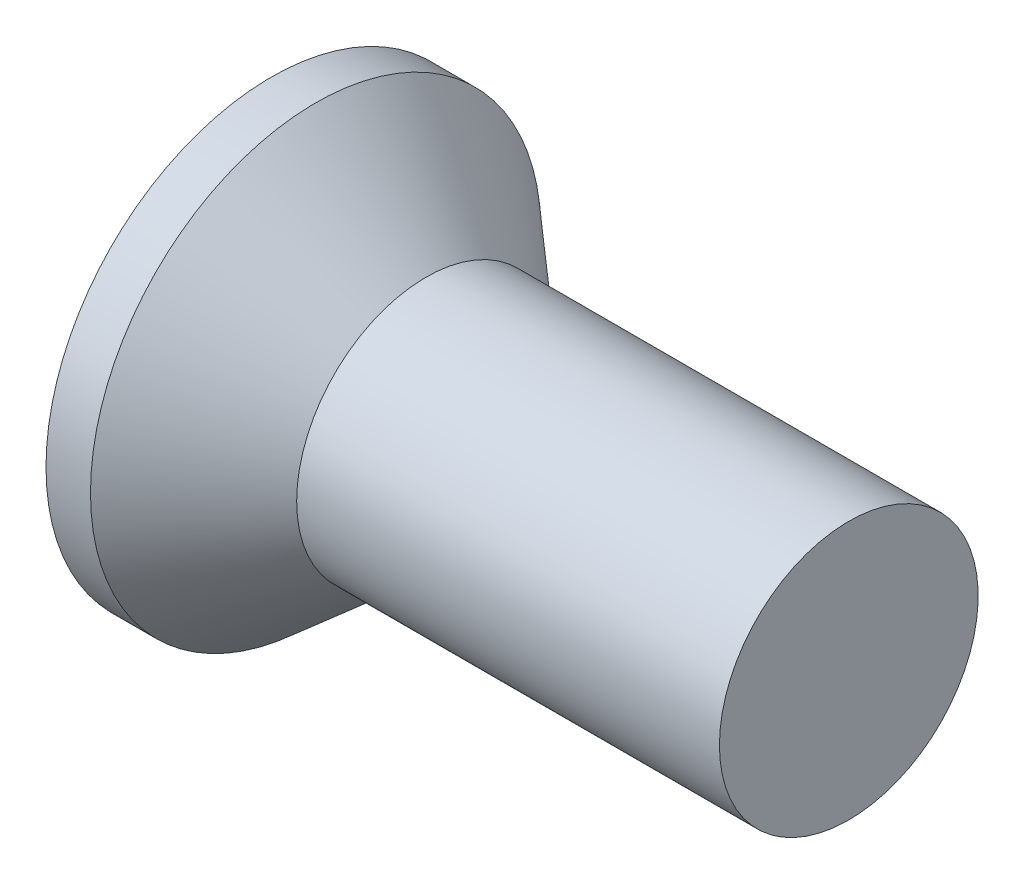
from build123d import *

# Parameters (mm, degrees)
CIRPATTERN1_COUNT = 2
CIRPATTERN1_ANGLE = 90


with BuildPart() as part:
    # BodySke → Base-Revolve (revolve)
    with BuildSketch(Plane.XY, mode=Mode.PRIVATE) as base_revolve_sk:
        Polygon((0, 0), (0, 2.4765), (0.489196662, 2.4765), (1.7018, 1.4224), (6.35, 1.4224), (6.35, 0), align=None)
    revolve(base_revolve_sk.sketch.rotate(Axis((-6.35, 0, 0), (1, 0, 0)), 90), axis=Axis((-6.35, 0, 0), (1, 0, 0)))

    # Sketch3 → Cross section 0
    with BuildSketch(Plane.ZY):
        with BuildLine():
            Line((-0.4064, 1.9939), (0.4064, 1.9939))
            Line((0.4064, 1.9939), (0.4064, -1.9939))
            Line((0.4064, -1.9939), (-0.4064, -1.9939))
            Line((-0.4064, -1.9939), (-0.4064, 1.9939))
        make_face()
    # Sketch4 → Cross section 1
    with BuildSketch(Plane.ZY.offset(-2.2352)):
        with BuildLine():
            Line((-0.2032, 0.2032), (0.2032, 0.2032))
            Line((0.2032, 0.2032), (0.2032, -0.2032))
            Line((0.2032, -0.2032), (-0.2032, -0.2032))
            Line((-0.2032, -0.2032), (-0.2032, 0.2032))
        make_face()
    cross = loft(mode=Mode.SUBTRACT)

    # CirPattern1: Cross ×2 about axis
    cirpattern1_axis = Axis((0, 0, 0), (1, 0, 0))
    for i in range(1, CIRPATTERN1_COUNT):
        add(cross.rotate(cirpattern1_axis, i * CIRPATTERN1_ANGLE / (CIRPATTERN1_COUNT - 1)), mode=Mode.SUBTRACT)


solid = part.part
